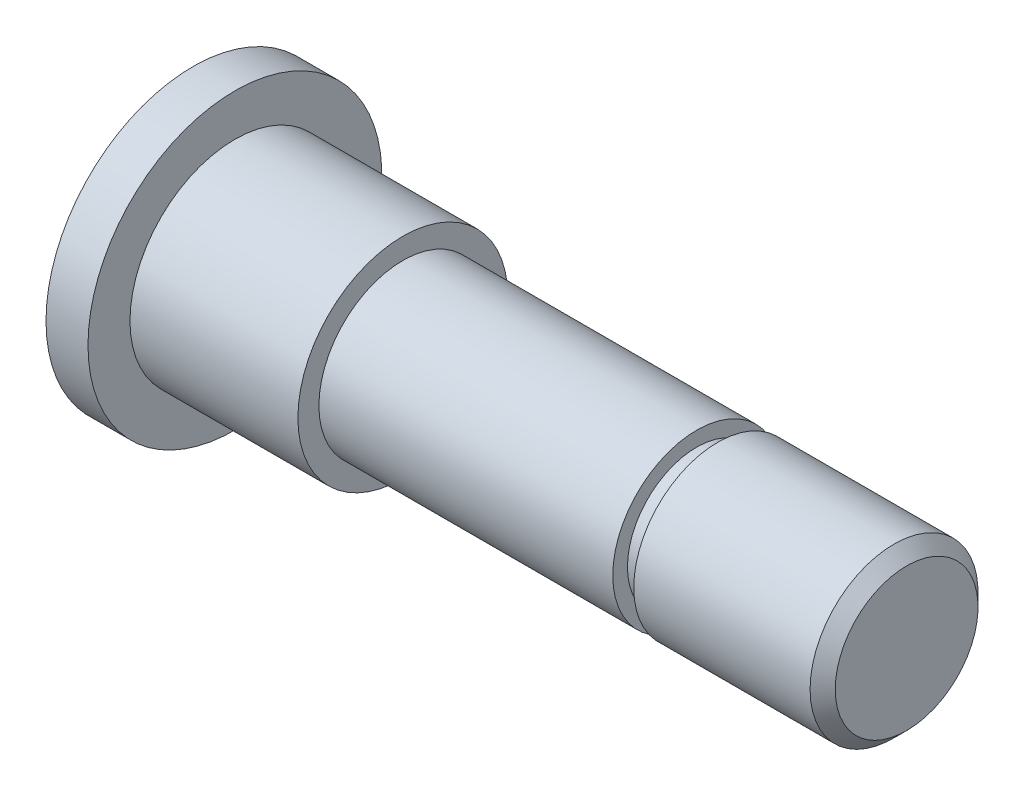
from build123d import *

# Parameters (mm, degrees)
CHANFREIN1_SIZE = 0.6


with BuildPart() as part:
    # Esquisse1 → Base-R_volution (revolve)
    with BuildSketch(Plane.XY, mode=Mode.PRIVATE) as base_r_volution_sk:
        Polygon((0, 0), (0, 7), (2, 7), (2, 5), (10, 5), (10, 4), (24, 4), (24, 3.3), (25, 3.3), (25, 4), (34, 4), (34, 0), align=None)
    revolve(base_r_volution_sk.sketch.rotate(Axis((-12.574722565, 0, 0), (1, 0, 0)), 90), axis=Axis((-12.574722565, 0, 0), (1, 0, 0)))

    # Chanfrein1
    chanfrein1_edges = [part.edges().sort_by_distance(p)[0] for p in [
        (34, 0, -4),
    ]]
    chamfer(chanfrein1_edges, length=CHANFREIN1_SIZE)


solid = part.part
